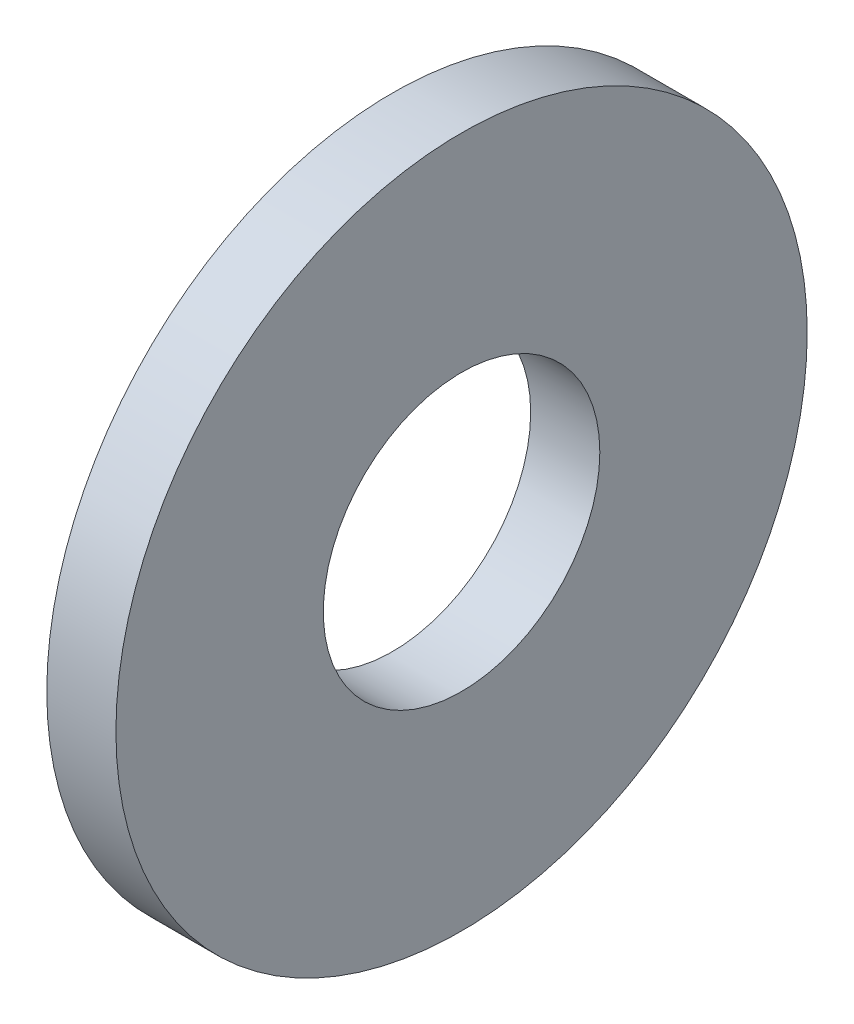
from build123d import *

# Parameters (mm, degrees)
SKETCH1_R          = 5
SKETCH1_R_2        = 2
BASE_EXTRUDE_DEPTH = 1


with BuildPart() as part:
    # Sketch1 → Base-Extrude (new body)
    with BuildSketch(Plane(origin=(0, 0, 0), x_dir=(0, 0, -1), z_dir=(1, 0, 0))):
        Circle(SKETCH1_R)
        Circle(SKETCH1_R_2, mode=Mode.SUBTRACT)
    extrude(amount=BASE_EXTRUDE_DEPTH)


solid = part.part
